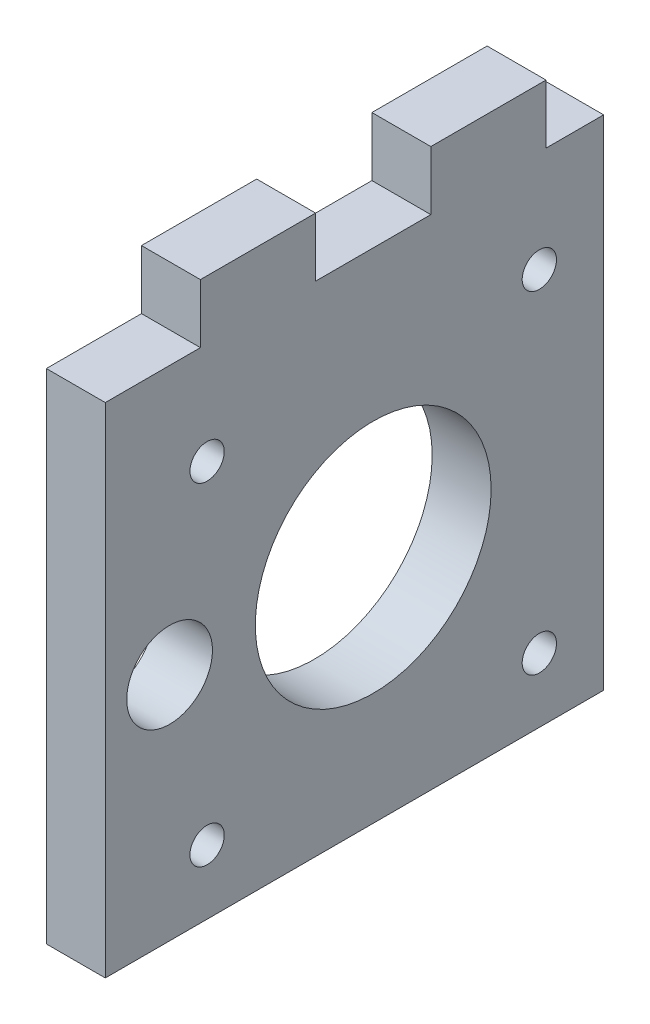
ISO-10303-21;
HEADER;
FILE_DESCRIPTION(('STEP AP214'),'2;1');
FILE_NAME('part.step','',(''),(''),'','','');
FILE_SCHEMA(('AUTOMOTIVE_DESIGN { 1 0 10303 214 1 1 1 1 }'));
ENDSEC;
DATA;
#1=APPLICATION_CONTEXT('core data for automotive mechanical design processes');
#2=APPLICATION_PROTOCOL_DEFINITION('international standard','automotive_design',2000,#1);
#3=PRODUCT_CONTEXT('',#1,'mechanical');
#4=PRODUCT('Part','Part','',(#3));
#5=PRODUCT_RELATED_PRODUCT_CATEGORY('part','',(#4));
#6=PRODUCT_DEFINITION_FORMATION('','',#4);
#7=PRODUCT_DEFINITION_CONTEXT('part definition',#1,'design');
#8=PRODUCT_DEFINITION('design','',#6,#7);
#9=PRODUCT_DEFINITION_SHAPE('','',#8);
#10=(LENGTH_UNIT() NAMED_UNIT(*) SI_UNIT(.MILLI.,.METRE.));
#11=(NAMED_UNIT(*) PLANE_ANGLE_UNIT() SI_UNIT($,.RADIAN.));
#12=(NAMED_UNIT(*) SI_UNIT($,.STERADIAN.) SOLID_ANGLE_UNIT());
#13=UNCERTAINTY_MEASURE_WITH_UNIT(LENGTH_MEASURE(1.E-05),#10,'distance_accuracy_value','');
#14=(GEOMETRIC_REPRESENTATION_CONTEXT(3) GLOBAL_UNCERTAINTY_ASSIGNED_CONTEXT((#13)) GLOBAL_UNIT_ASSIGNED_CONTEXT((#10,
#11,#12)) REPRESENTATION_CONTEXT('',''));
#15=CARTESIAN_POINT('',(0.,0.,0.));
#16=DIRECTION('',(0.,0.,1.));
#17=DIRECTION('',(1.,0.,0.));
#18=AXIS2_PLACEMENT_3D('',#15,#16,#17);
#19=CARTESIAN_POINT('',(5.5,0.,0.));
#20=DIRECTION('',(0.,0.,-1.));
#21=DIRECTION('',(-1.,0.,0.));
#22=AXIS2_PLACEMENT_3D('',#19,#20,#21);
#23=PLANE('',#22);
#24=DIRECTION('',(0.,-1.,0.));
#25=VECTOR('',#24,1.);
#26=CARTESIAN_POINT('',(0.,0.,0.));
#27=LINE('',#26,#25);
#28=CARTESIAN_POINT('',(0.,46.5,0.));
#29=VERTEX_POINT('',#28);
#30=CARTESIAN_POINT('',(0.,0.,0.));
#31=VERTEX_POINT('',#30);
#32=EDGE_CURVE('E189',#29,#31,#27,.T.);
#33=ORIENTED_EDGE('',*,*,#32,.F.);
#34=DIRECTION('',(-1.,0.,0.));
#35=VECTOR('',#34,1.);
#36=CARTESIAN_POINT('',(5.5,46.5,0.));
#37=LINE('',#36,#35);
#38=CARTESIAN_POINT('',(5.5,46.5,0.));
#39=VERTEX_POINT('',#38);
#40=EDGE_CURVE('E11',#39,#29,#37,.T.);
#41=ORIENTED_EDGE('',*,*,#40,.F.);
#42=DIRECTION('',(0.,-1.,0.));
#43=VECTOR('',#42,1.);
#44=CARTESIAN_POINT('',(5.5,0.,0.));
#45=LINE('',#44,#43);
#46=CARTESIAN_POINT('',(5.5,0.,0.));
#47=VERTEX_POINT('',#46);
#48=EDGE_CURVE('E469',#39,#47,#45,.T.);
#49=ORIENTED_EDGE('',*,*,#48,.T.);
#50=DIRECTION('',(-1.,0.,0.));
#51=VECTOR('',#50,1.);
#52=CARTESIAN_POINT('',(5.5,0.,0.));
#53=LINE('',#52,#51);
#54=EDGE_CURVE('E102',#47,#31,#53,.T.);
#55=ORIENTED_EDGE('',*,*,#54,.T.);
#56=EDGE_LOOP('',(#33,#41,#49,#55));
#57=FACE_BOUND('',#56,.T.);
#58=ADVANCED_FACE('F39',(#57),#23,.T.);
#59=CARTESIAN_POINT('',(5.5,46.5,0.));
#60=DIRECTION('',(0.,1.,0.));
#61=DIRECTION('',(0.,0.,1.));
#62=AXIS2_PLACEMENT_3D('',#59,#60,#61);
#63=PLANE('',#62);
#64=DIRECTION('',(0.,0.,-1.));
#65=VECTOR('',#64,1.);
#66=CARTESIAN_POINT('',(0.,46.5,0.));
#67=LINE('',#66,#65);
#68=CARTESIAN_POINT('',(0.,46.5,5.375));
#69=VERTEX_POINT('',#68);
#70=EDGE_CURVE('E187',#69,#29,#67,.T.);
#71=ORIENTED_EDGE('',*,*,#70,.F.);
#72=DIRECTION('',(-1.,0.,0.));
#73=VECTOR('',#72,1.);
#74=CARTESIAN_POINT('',(5.5,46.5,5.375));
#75=LINE('',#74,#73);
#76=CARTESIAN_POINT('',(5.5,46.5,5.375));
#77=VERTEX_POINT('',#76);
#78=EDGE_CURVE('E48',#77,#69,#75,.T.);
#79=ORIENTED_EDGE('',*,*,#78,.F.);
#80=DIRECTION('',(0.,0.,-1.));
#81=VECTOR('',#80,1.);
#82=CARTESIAN_POINT('',(5.5,46.5,0.));
#83=LINE('',#82,#81);
#84=EDGE_CURVE('E467',#77,#39,#83,.T.);
#85=ORIENTED_EDGE('',*,*,#84,.T.);
#86=ORIENTED_EDGE('',*,*,#40,.T.);
#87=EDGE_LOOP('',(#71,#79,#85,#86));
#88=FACE_BOUND('',#87,.T.);
#89=ADVANCED_FACE('F188',(#88),#63,.T.);
#90=CARTESIAN_POINT('',(5.5,0.,5.37500000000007));
#91=DIRECTION('',(0.,0.,-1.));
#92=DIRECTION('',(0.,1.,0.));
#93=AXIS2_PLACEMENT_3D('',#90,#91,#92);
#94=PLANE('',#93);
#95=DIRECTION('',(0.,-1.,0.));
#96=VECTOR('',#95,1.);
#97=CARTESIAN_POINT('',(0.,0.,5.37500000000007));
#98=LINE('',#97,#96);
#99=CARTESIAN_POINT('',(0.,52.,5.37499999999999));
#100=VERTEX_POINT('',#99);
#101=EDGE_CURVE('E179',#100,#69,#98,.T.);
#102=ORIENTED_EDGE('',*,*,#101,.F.);
#103=DIRECTION('',(-1.,0.,0.));
#104=VECTOR('',#103,1.);
#105=CARTESIAN_POINT('',(5.5,52.,5.37499999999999));
#106=LINE('',#105,#104);
#107=CARTESIAN_POINT('',(5.5,52.,5.37499999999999));
#108=VERTEX_POINT('',#107);
#109=EDGE_CURVE('E172',#108,#100,#106,.T.);
#110=ORIENTED_EDGE('',*,*,#109,.F.);
#111=DIRECTION('',(0.,-1.,0.));
#112=VECTOR('',#111,1.);
#113=CARTESIAN_POINT('',(5.5,0.,5.37500000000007));
#114=LINE('',#113,#112);
#115=EDGE_CURVE('E182',#108,#77,#114,.T.);
#116=ORIENTED_EDGE('',*,*,#115,.T.);
#117=ORIENTED_EDGE('',*,*,#78,.T.);
#118=EDGE_LOOP('',(#102,#110,#116,#117));
#119=FACE_BOUND('',#118,.T.);
#120=ADVANCED_FACE('F177',(#119),#94,.T.);
#121=CARTESIAN_POINT('',(5.5,52.,0.));
#122=DIRECTION('',(0.,1.,0.));
#123=DIRECTION('',(0.,0.,1.));
#124=AXIS2_PLACEMENT_3D('',#121,#122,#123);
#125=PLANE('',#124);
#126=DIRECTION('',(0.,0.,-1.));
#127=VECTOR('',#126,1.);
#128=CARTESIAN_POINT('',(0.,52.,0.));
#129=LINE('',#128,#127);
#130=CARTESIAN_POINT('',(0.,52.,16.125));
#131=VERTEX_POINT('',#130);
#132=EDGE_CURVE('E194',#131,#100,#129,.T.);
#133=ORIENTED_EDGE('',*,*,#132,.F.);
#134=DIRECTION('',(-1.,0.,0.));
#135=VECTOR('',#134,1.);
#136=CARTESIAN_POINT('',(5.5,52.,16.125));
#137=LINE('',#136,#135);
#138=CARTESIAN_POINT('',(5.5,52.,16.125));
#139=VERTEX_POINT('',#138);
#140=EDGE_CURVE('E170',#139,#131,#137,.T.);
#141=ORIENTED_EDGE('',*,*,#140,.F.);
#142=DIRECTION('',(0.,0.,-1.));
#143=VECTOR('',#142,1.);
#144=CARTESIAN_POINT('',(5.5,52.,0.));
#145=LINE('',#144,#143);
#146=EDGE_CURVE('E452',#139,#108,#145,.T.);
#147=ORIENTED_EDGE('',*,*,#146,.T.);
#148=ORIENTED_EDGE('',*,*,#109,.T.);
#149=EDGE_LOOP('',(#133,#141,#147,#148));
#150=FACE_BOUND('',#149,.T.);
#151=ADVANCED_FACE('F320',(#150),#125,.T.);
#152=CARTESIAN_POINT('',(5.5,0.,16.125));
#153=DIRECTION('',(0.,0.,1.));
#154=DIRECTION('',(1.,0.,0.));
#155=AXIS2_PLACEMENT_3D('',#152,#153,#154);
#156=PLANE('',#155);
#157=DIRECTION('',(0.,1.,0.));
#158=VECTOR('',#157,1.);
#159=CARTESIAN_POINT('',(0.,0.,16.125));
#160=LINE('',#159,#158);
#161=CARTESIAN_POINT('',(0.,46.5,16.125));
#162=VERTEX_POINT('',#161);
#163=EDGE_CURVE('E196',#162,#131,#160,.T.);
#164=ORIENTED_EDGE('',*,*,#163,.F.);
#165=DIRECTION('',(-1.,0.,0.));
#166=VECTOR('',#165,1.);
#167=CARTESIAN_POINT('',(5.5,46.5,16.125));
#168=LINE('',#167,#166);
#169=CARTESIAN_POINT('',(5.5,46.5,16.125));
#170=VERTEX_POINT('',#169);
#171=EDGE_CURVE('E168',#170,#162,#168,.T.);
#172=ORIENTED_EDGE('',*,*,#171,.F.);
#173=DIRECTION('',(0.,1.,0.));
#174=VECTOR('',#173,1.);
#175=CARTESIAN_POINT('',(5.5,0.,16.125));
#176=LINE('',#175,#174);
#177=EDGE_CURVE('E449',#170,#139,#176,.T.);
#178=ORIENTED_EDGE('',*,*,#177,.T.);
#179=ORIENTED_EDGE('',*,*,#140,.T.);
#180=EDGE_LOOP('',(#164,#172,#178,#179));
#181=FACE_BOUND('',#180,.T.);
#182=ADVANCED_FACE('F316',(#181),#156,.T.);
#183=CARTESIAN_POINT('',(5.5,46.5,0.));
#184=DIRECTION('',(0.,-1.,0.));
#185=DIRECTION('',(0.,0.,-1.));
#186=AXIS2_PLACEMENT_3D('',#183,#184,#185);
#187=PLANE('',#186);
#188=DIRECTION('',(0.,0.,1.));
#189=VECTOR('',#188,1.);
#190=CARTESIAN_POINT('',(0.,46.5,0.));
#191=LINE('',#190,#189);
#192=CARTESIAN_POINT('',(0.,46.5,26.875));
#193=VERTEX_POINT('',#192);
#194=EDGE_CURVE('E201',#162,#193,#191,.T.);
#195=ORIENTED_EDGE('',*,*,#194,.T.);
#196=DIRECTION('',(-1.,0.,0.));
#197=VECTOR('',#196,1.);
#198=CARTESIAN_POINT('',(5.5,46.5,26.875));
#199=LINE('',#198,#197);
#200=CARTESIAN_POINT('',(5.5,46.5,26.875));
#201=VERTEX_POINT('',#200);
#202=EDGE_CURVE('E165',#201,#193,#199,.T.);
#203=ORIENTED_EDGE('',*,*,#202,.F.);
#204=DIRECTION('',(0.,0.,1.));
#205=VECTOR('',#204,1.);
#206=CARTESIAN_POINT('',(5.5,46.5,0.));
#207=LINE('',#206,#205);
#208=EDGE_CURVE('E451',#170,#201,#207,.T.);
#209=ORIENTED_EDGE('',*,*,#208,.F.);
#210=ORIENTED_EDGE('',*,*,#171,.T.);
#211=EDGE_LOOP('',(#195,#203,#209,#210));
#212=FACE_BOUND('',#211,.T.);
#213=ADVANCED_FACE('F312',(#212),#187,.F.);
#214=CARTESIAN_POINT('',(5.5,0.,26.875));
#215=DIRECTION('',(0.,0.,1.));
#216=DIRECTION('',(1.,0.,0.));
#217=AXIS2_PLACEMENT_3D('',#214,#215,#216);
#218=PLANE('',#217);
#219=DIRECTION('',(0.,1.,0.));
#220=VECTOR('',#219,1.);
#221=CARTESIAN_POINT('',(0.,0.,26.875));
#222=LINE('',#221,#220);
#223=CARTESIAN_POINT('',(0.,52.,26.875));
#224=VERTEX_POINT('',#223);
#225=EDGE_CURVE('E204',#193,#224,#222,.T.);
#226=ORIENTED_EDGE('',*,*,#225,.T.);
#227=DIRECTION('',(-1.,0.,0.));
#228=VECTOR('',#227,1.);
#229=CARTESIAN_POINT('',(5.5,52.,26.875));
#230=LINE('',#229,#228);
#231=CARTESIAN_POINT('',(5.5,52.,26.875));
#232=VERTEX_POINT('',#231);
#233=EDGE_CURVE('E162',#232,#224,#230,.T.);
#234=ORIENTED_EDGE('',*,*,#233,.F.);
#235=DIRECTION('',(0.,1.,0.));
#236=VECTOR('',#235,1.);
#237=CARTESIAN_POINT('',(5.5,0.,26.875));
#238=LINE('',#237,#236);
#239=EDGE_CURVE('E454',#201,#232,#238,.T.);
#240=ORIENTED_EDGE('',*,*,#239,.F.);
#241=ORIENTED_EDGE('',*,*,#202,.T.);
#242=EDGE_LOOP('',(#226,#234,#240,#241));
#243=FACE_BOUND('',#242,.T.);
#244=ADVANCED_FACE('F308',(#243),#218,.F.);
#245=CARTESIAN_POINT('',(5.5,52.,0.));
#246=DIRECTION('',(0.,-1.,0.));
#247=DIRECTION('',(0.,0.,-1.));
#248=AXIS2_PLACEMENT_3D('',#245,#246,#247);
#249=PLANE('',#248);
#250=DIRECTION('',(0.,0.,1.));
#251=VECTOR('',#250,1.);
#252=CARTESIAN_POINT('',(0.,52.,0.));
#253=LINE('',#252,#251);
#254=CARTESIAN_POINT('',(0.,52.,37.625));
#255=VERTEX_POINT('',#254);
#256=EDGE_CURVE('E207',#224,#255,#253,.T.);
#257=ORIENTED_EDGE('',*,*,#256,.T.);
#258=DIRECTION('',(-1.,0.,0.));
#259=VECTOR('',#258,1.);
#260=CARTESIAN_POINT('',(5.5,52.,37.625));
#261=LINE('',#260,#259);
#262=CARTESIAN_POINT('',(5.5,52.,37.625));
#263=VERTEX_POINT('',#262);
#264=EDGE_CURVE('E155',#263,#255,#261,.T.);
#265=ORIENTED_EDGE('',*,*,#264,.F.);
#266=DIRECTION('',(0.,0.,1.));
#267=VECTOR('',#266,1.);
#268=CARTESIAN_POINT('',(5.5,52.,0.));
#269=LINE('',#268,#267);
#270=EDGE_CURVE('E461',#232,#263,#269,.T.);
#271=ORIENTED_EDGE('',*,*,#270,.F.);
#272=ORIENTED_EDGE('',*,*,#233,.T.);
#273=EDGE_LOOP('',(#257,#265,#271,#272));
#274=FACE_BOUND('',#273,.T.);
#275=ADVANCED_FACE('F304',(#274),#249,.F.);
#276=CARTESIAN_POINT('',(5.5,0.,37.625));
#277=DIRECTION('',(0.,0.,-1.));
#278=DIRECTION('',(-1.,0.,0.));
#279=AXIS2_PLACEMENT_3D('',#276,#277,#278);
#280=PLANE('',#279);
#281=DIRECTION('',(0.,-1.,0.));
#282=VECTOR('',#281,1.);
#283=CARTESIAN_POINT('',(0.,0.,37.625));
#284=LINE('',#283,#282);
#285=CARTESIAN_POINT('',(0.,46.5,37.625));
#286=VERTEX_POINT('',#285);
#287=EDGE_CURVE('E210',#255,#286,#284,.T.);
#288=ORIENTED_EDGE('',*,*,#287,.T.);
#289=DIRECTION('',(-1.,0.,0.));
#290=VECTOR('',#289,1.);
#291=CARTESIAN_POINT('',(5.5,46.5,37.625));
#292=LINE('',#291,#290);
#293=CARTESIAN_POINT('',(5.5,46.5,37.625));
#294=VERTEX_POINT('',#293);
#295=EDGE_CURVE('E153',#294,#286,#292,.T.);
#296=ORIENTED_EDGE('',*,*,#295,.F.);
#297=DIRECTION('',(0.,-1.,0.));
#298=VECTOR('',#297,1.);
#299=CARTESIAN_POINT('',(5.5,0.,37.625));
#300=LINE('',#299,#298);
#301=EDGE_CURVE('E146',#263,#294,#300,.T.);
#302=ORIENTED_EDGE('',*,*,#301,.F.);
#303=ORIENTED_EDGE('',*,*,#264,.T.);
#304=EDGE_LOOP('',(#288,#296,#302,#303));
#305=FACE_BOUND('',#304,.T.);
#306=ADVANCED_FACE('F301',(#305),#280,.F.);
#307=CARTESIAN_POINT('',(5.5,46.5,0.));
#308=DIRECTION('',(0.,-1.,0.));
#309=DIRECTION('',(0.,0.,-1.));
#310=AXIS2_PLACEMENT_3D('',#307,#308,#309);
#311=PLANE('',#310);
#312=DIRECTION('',(0.,0.,1.));
#313=VECTOR('',#312,1.);
#314=CARTESIAN_POINT('',(0.,46.5,0.));
#315=LINE('',#314,#313);
#316=CARTESIAN_POINT('',(0.,46.5,46.5));
#317=VERTEX_POINT('',#316);
#318=EDGE_CURVE('E152',#286,#317,#315,.T.);
#319=ORIENTED_EDGE('',*,*,#318,.T.);
#320=DIRECTION('',(-1.,0.,0.));
#321=VECTOR('',#320,1.);
#322=CARTESIAN_POINT('',(5.5,46.5,46.5));
#323=LINE('',#322,#321);
#324=CARTESIAN_POINT('',(5.5,46.5,46.5));
#325=VERTEX_POINT('',#324);
#326=EDGE_CURVE('E138',#325,#317,#323,.T.);
#327=ORIENTED_EDGE('',*,*,#326,.F.);
#328=DIRECTION('',(0.,0.,1.));
#329=VECTOR('',#328,1.);
#330=CARTESIAN_POINT('',(5.5,46.5,0.));
#331=LINE('',#330,#329);
#332=EDGE_CURVE('E141',#294,#325,#331,.T.);
#333=ORIENTED_EDGE('',*,*,#332,.F.);
#334=ORIENTED_EDGE('',*,*,#295,.T.);
#335=EDGE_LOOP('',(#319,#327,#333,#334));
#336=FACE_BOUND('',#335,.T.);
#337=ADVANCED_FACE('F151',(#336),#311,.F.);
#338=CARTESIAN_POINT('',(5.5,0.,46.5));
#339=DIRECTION('',(0.,0.,-1.));
#340=DIRECTION('',(0.,1.,0.));
#341=AXIS2_PLACEMENT_3D('',#338,#339,#340);
#342=PLANE('',#341);
#343=DIRECTION('',(0.,-1.,0.));
#344=VECTOR('',#343,1.);
#345=CARTESIAN_POINT('',(0.,0.,46.5));
#346=LINE('',#345,#344);
#347=CARTESIAN_POINT('',(0.,0.,46.5));
#348=VERTEX_POINT('',#347);
#349=EDGE_CURVE('E214',#317,#348,#346,.T.);
#350=ORIENTED_EDGE('',*,*,#349,.T.);
#351=DIRECTION('',(-1.,0.,0.));
#352=VECTOR('',#351,1.);
#353=CARTESIAN_POINT('',(5.5,0.,46.5));
#354=LINE('',#353,#352);
#355=CARTESIAN_POINT('',(5.5,0.,46.5));
#356=VERTEX_POINT('',#355);
#357=EDGE_CURVE('E140',#356,#348,#354,.T.);
#358=ORIENTED_EDGE('',*,*,#357,.F.);
#359=DIRECTION('',(0.,-1.,0.));
#360=VECTOR('',#359,1.);
#361=CARTESIAN_POINT('',(5.5,0.,46.5));
#362=LINE('',#361,#360);
#363=EDGE_CURVE('E133',#325,#356,#362,.T.);
#364=ORIENTED_EDGE('',*,*,#363,.F.);
#365=ORIENTED_EDGE('',*,*,#326,.T.);
#366=EDGE_LOOP('',(#350,#358,#364,#365));
#367=FACE_BOUND('',#366,.T.);
#368=ADVANCED_FACE('F136',(#367),#342,.F.);
#369=CARTESIAN_POINT('',(5.5,21.5,21.5));
#370=DIRECTION('',(-1.,0.,0.));
#371=DIRECTION('',(0.,0.,1.));
#372=AXIS2_PLACEMENT_3D('',#369,#370,#371);
#373=CYLINDRICAL_SURFACE('',#372,11.);
#374=CARTESIAN_POINT('',(5.5,21.5,21.5));
#375=DIRECTION('',(1.,0.,0.));
#376=DIRECTION('',(0.,0.,-1.));
#377=AXIS2_PLACEMENT_3D('',#374,#375,#376);
#378=CIRCLE('',#377,11.);
#379=CARTESIAN_POINT('',(5.5,21.5,10.5));
#380=VERTEX_POINT('',#379);
#381=EDGE_CURVE('E471',#380,#380,#378,.T.);
#382=ORIENTED_EDGE('',*,*,#381,.T.);
#383=EDGE_LOOP('',(#382));
#384=FACE_BOUND('',#383,.T.);
#385=CARTESIAN_POINT('',(0.,21.5,21.5));
#386=DIRECTION('',(1.,0.,0.));
#387=DIRECTION('',(0.,0.,-1.));
#388=AXIS2_PLACEMENT_3D('',#385,#386,#387);
#389=CIRCLE('',#388,11.);
#390=CARTESIAN_POINT('',(0.,21.5,10.5));
#391=VERTEX_POINT('',#390);
#392=EDGE_CURVE('E234',#391,#391,#389,.T.);
#393=ORIENTED_EDGE('',*,*,#392,.F.);
#394=EDGE_LOOP('',(#393));
#395=FACE_BOUND('',#394,.T.);
#396=ADVANCED_FACE('F244',(#384,#395),#373,.F.);
#397=CARTESIAN_POINT('',(5.5,37.,6.));
#398=DIRECTION('',(-1.,0.,0.));
#399=DIRECTION('',(0.,0.,1.));
#400=AXIS2_PLACEMENT_3D('',#397,#398,#399);
#401=CYLINDRICAL_SURFACE('',#400,1.6);
#402=CARTESIAN_POINT('',(5.5,37.,6.));
#403=DIRECTION('',(1.,0.,0.));
#404=DIRECTION('',(0.,0.,-1.));
#405=AXIS2_PLACEMENT_3D('',#402,#403,#404);
#406=CIRCLE('',#405,1.6);
#407=CARTESIAN_POINT('',(5.5,37.,4.4));
#408=VERTEX_POINT('',#407);
#409=EDGE_CURVE('E474',#408,#408,#406,.T.);
#410=ORIENTED_EDGE('',*,*,#409,.T.);
#411=EDGE_LOOP('',(#410));
#412=FACE_BOUND('',#411,.T.);
#413=CARTESIAN_POINT('',(0.,37.,6.));
#414=DIRECTION('',(1.,0.,0.));
#415=DIRECTION('',(0.,0.,-1.));
#416=AXIS2_PLACEMENT_3D('',#413,#414,#415);
#417=CIRCLE('',#416,1.6);
#418=CARTESIAN_POINT('',(0.,37.,4.4));
#419=VERTEX_POINT('',#418);
#420=EDGE_CURVE('E231',#419,#419,#417,.T.);
#421=ORIENTED_EDGE('',*,*,#420,.F.);
#422=EDGE_LOOP('',(#421));
#423=FACE_BOUND('',#422,.T.);
#424=ADVANCED_FACE('F247',(#412,#423),#401,.F.);
#425=CARTESIAN_POINT('',(5.5,5.99999999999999,5.99999999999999));
#426=DIRECTION('',(-1.,0.,0.));
#427=DIRECTION('',(0.,0.,1.));
#428=AXIS2_PLACEMENT_3D('',#425,#426,#427);
#429=CYLINDRICAL_SURFACE('',#428,1.6);
#430=CARTESIAN_POINT('',(5.5,5.99999999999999,5.99999999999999));
#431=DIRECTION('',(1.,0.,0.));
#432=DIRECTION('',(0.,0.,-1.));
#433=AXIS2_PLACEMENT_3D('',#430,#431,#432);
#434=CIRCLE('',#433,1.6);
#435=CARTESIAN_POINT('',(5.5,5.99999999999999,4.39999999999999));
#436=VERTEX_POINT('',#435);
#437=EDGE_CURVE('E477',#436,#436,#434,.T.);
#438=ORIENTED_EDGE('',*,*,#437,.T.);
#439=EDGE_LOOP('',(#438));
#440=FACE_BOUND('',#439,.T.);
#441=CARTESIAN_POINT('',(0.,5.99999999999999,5.99999999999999));
#442=DIRECTION('',(1.,0.,0.));
#443=DIRECTION('',(0.,0.,-1.));
#444=AXIS2_PLACEMENT_3D('',#441,#442,#443);
#445=CIRCLE('',#444,1.6);
#446=CARTESIAN_POINT('',(0.,5.99999999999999,4.39999999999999));
#447=VERTEX_POINT('',#446);
#448=EDGE_CURVE('E228',#447,#447,#445,.T.);
#449=ORIENTED_EDGE('',*,*,#448,.F.);
#450=EDGE_LOOP('',(#449));
#451=FACE_BOUND('',#450,.T.);
#452=ADVANCED_FACE('F251',(#440,#451),#429,.F.);
#453=CARTESIAN_POINT('',(5.5,6.00000000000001,37.));
#454=DIRECTION('',(-1.,0.,0.));
#455=DIRECTION('',(0.,0.,1.));
#456=AXIS2_PLACEMENT_3D('',#453,#454,#455);
#457=CYLINDRICAL_SURFACE('',#456,1.6);
#458=CARTESIAN_POINT('',(5.5,6.00000000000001,37.));
#459=DIRECTION('',(1.,0.,0.));
#460=DIRECTION('',(0.,0.,-1.));
#461=AXIS2_PLACEMENT_3D('',#458,#459,#460);
#462=CIRCLE('',#461,1.6);
#463=CARTESIAN_POINT('',(5.5,6.00000000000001,35.4));
#464=VERTEX_POINT('',#463);
#465=EDGE_CURVE('E480',#464,#464,#462,.T.);
#466=ORIENTED_EDGE('',*,*,#465,.T.);
#467=EDGE_LOOP('',(#466));
#468=FACE_BOUND('',#467,.T.);
#469=CARTESIAN_POINT('',(0.,6.00000000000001,37.));
#470=DIRECTION('',(1.,0.,0.));
#471=DIRECTION('',(0.,0.,-1.));
#472=AXIS2_PLACEMENT_3D('',#469,#470,#471);
#473=CIRCLE('',#472,1.6);
#474=CARTESIAN_POINT('',(0.,6.00000000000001,35.4));
#475=VERTEX_POINT('',#474);
#476=EDGE_CURVE('E225',#475,#475,#473,.T.);
#477=ORIENTED_EDGE('',*,*,#476,.F.);
#478=EDGE_LOOP('',(#477));
#479=FACE_BOUND('',#478,.T.);
#480=ADVANCED_FACE('F255',(#468,#479),#457,.F.);
#481=CARTESIAN_POINT('',(5.5,37.,37.));
#482=DIRECTION('',(-1.,0.,0.));
#483=DIRECTION('',(0.,0.,1.));
#484=AXIS2_PLACEMENT_3D('',#481,#482,#483);
#485=CYLINDRICAL_SURFACE('',#484,1.6);
#486=CARTESIAN_POINT('',(5.5,37.,37.));
#487=DIRECTION('',(1.,0.,0.));
#488=DIRECTION('',(0.,0.,-1.));
#489=AXIS2_PLACEMENT_3D('',#486,#487,#488);
#490=CIRCLE('',#489,1.6);
#491=CARTESIAN_POINT('',(5.5,37.,35.4));
#492=VERTEX_POINT('',#491);
#493=EDGE_CURVE('E270',#492,#492,#490,.T.);
#494=ORIENTED_EDGE('',*,*,#493,.T.);
#495=EDGE_LOOP('',(#494));
#496=FACE_BOUND('',#495,.T.);
#497=CARTESIAN_POINT('',(0.,37.,37.));
#498=DIRECTION('',(1.,0.,0.));
#499=DIRECTION('',(0.,0.,-1.));
#500=AXIS2_PLACEMENT_3D('',#497,#498,#499);
#501=CIRCLE('',#500,1.6);
#502=CARTESIAN_POINT('',(0.,37.,35.4));
#503=VERTEX_POINT('',#502);
#504=EDGE_CURVE('E222',#503,#503,#501,.T.);
#505=ORIENTED_EDGE('',*,*,#504,.F.);
#506=EDGE_LOOP('',(#505));
#507=FACE_BOUND('',#506,.T.);
#508=ADVANCED_FACE('F258',(#496,#507),#485,.F.);
#509=CARTESIAN_POINT('',(5.5,21.5,40.5));
#510=DIRECTION('',(-1.,0.,0.));
#511=DIRECTION('',(0.,0.,1.));
#512=AXIS2_PLACEMENT_3D('',#509,#510,#511);
#513=CYLINDRICAL_SURFACE('',#512,4.);
#514=CARTESIAN_POINT('',(5.5,21.5,40.5));
#515=DIRECTION('',(1.,0.,0.));
#516=DIRECTION('',(0.,0.,-1.));
#517=AXIS2_PLACEMENT_3D('',#514,#515,#516);
#518=CIRCLE('',#517,4.);
#519=CARTESIAN_POINT('',(5.5,21.5,36.5));
#520=VERTEX_POINT('',#519);
#521=EDGE_CURVE('E216',#520,#520,#518,.T.);
#522=ORIENTED_EDGE('',*,*,#521,.T.);
#523=EDGE_LOOP('',(#522));
#524=FACE_BOUND('',#523,.T.);
#525=CARTESIAN_POINT('',(0.,21.5,40.5));
#526=DIRECTION('',(1.,0.,0.));
#527=DIRECTION('',(0.,0.,-1.));
#528=AXIS2_PLACEMENT_3D('',#525,#526,#527);
#529=CIRCLE('',#528,4.);
#530=CARTESIAN_POINT('',(0.,21.5,36.5));
#531=VERTEX_POINT('',#530);
#532=EDGE_CURVE('E219',#531,#531,#529,.T.);
#533=ORIENTED_EDGE('',*,*,#532,.F.);
#534=EDGE_LOOP('',(#533));
#535=FACE_BOUND('',#534,.T.);
#536=ADVANCED_FACE('F41',(#524,#535),#513,.F.);
#537=CARTESIAN_POINT('',(5.5,0.,0.));
#538=DIRECTION('',(0.,1.,0.));
#539=DIRECTION('',(0.,0.,1.));
#540=AXIS2_PLACEMENT_3D('',#537,#538,#539);
#541=PLANE('',#540);
#542=DIRECTION('',(0.,0.,-1.));
#543=VECTOR('',#542,1.);
#544=CARTESIAN_POINT('',(0.,0.,0.));
#545=LINE('',#544,#543);
#546=EDGE_CURVE('E95',#348,#31,#545,.T.);
#547=ORIENTED_EDGE('',*,*,#546,.T.);
#548=ORIENTED_EDGE('',*,*,#54,.F.);
#549=DIRECTION('',(0.,0.,-1.));
#550=VECTOR('',#549,1.);
#551=CARTESIAN_POINT('',(5.5,0.,0.));
#552=LINE('',#551,#550);
#553=EDGE_CURVE('E56',#356,#47,#552,.T.);
#554=ORIENTED_EDGE('',*,*,#553,.F.);
#555=ORIENTED_EDGE('',*,*,#357,.T.);
#556=EDGE_LOOP('',(#547,#548,#554,#555));
#557=FACE_BOUND('',#556,.T.);
#558=ADVANCED_FACE('F265',(#557),#541,.F.);
#559=CARTESIAN_POINT('',(5.5,0.,0.));
#560=DIRECTION('',(1.,0.,0.));
#561=DIRECTION('',(0.,0.,-1.));
#562=AXIS2_PLACEMENT_3D('',#559,#560,#561);
#563=PLANE('',#562);
#564=ORIENTED_EDGE('',*,*,#521,.F.);
#565=EDGE_LOOP('',(#564));
#566=FACE_BOUND('',#565,.T.);
#567=ORIENTED_EDGE('',*,*,#493,.F.);
#568=EDGE_LOOP('',(#567));
#569=FACE_BOUND('',#568,.T.);
#570=ORIENTED_EDGE('',*,*,#465,.F.);
#571=EDGE_LOOP('',(#570));
#572=FACE_BOUND('',#571,.T.);
#573=ORIENTED_EDGE('',*,*,#437,.F.);
#574=EDGE_LOOP('',(#573));
#575=FACE_BOUND('',#574,.T.);
#576=ORIENTED_EDGE('',*,*,#409,.F.);
#577=EDGE_LOOP('',(#576));
#578=FACE_BOUND('',#577,.T.);
#579=ORIENTED_EDGE('',*,*,#381,.F.);
#580=EDGE_LOOP('',(#579));
#581=FACE_BOUND('',#580,.T.);
#582=ORIENTED_EDGE('',*,*,#48,.F.);
#583=ORIENTED_EDGE('',*,*,#84,.F.);
#584=ORIENTED_EDGE('',*,*,#115,.F.);
#585=ORIENTED_EDGE('',*,*,#146,.F.);
#586=ORIENTED_EDGE('',*,*,#177,.F.);
#587=ORIENTED_EDGE('',*,*,#208,.T.);
#588=ORIENTED_EDGE('',*,*,#239,.T.);
#589=ORIENTED_EDGE('',*,*,#270,.T.);
#590=ORIENTED_EDGE('',*,*,#301,.T.);
#591=ORIENTED_EDGE('',*,*,#332,.T.);
#592=ORIENTED_EDGE('',*,*,#363,.T.);
#593=ORIENTED_EDGE('',*,*,#553,.T.);
#594=EDGE_LOOP('',(#582,#583,#584,#585,#586,#587,#588,#589,#590,#591,#592,#593));
#595=FACE_BOUND('',#594,.T.);
#596=ADVANCED_FACE('F144',(#566,#569,#572,#575,#578,#581,#595),#563,.T.);
#597=CARTESIAN_POINT('',(0.,0.,0.));
#598=DIRECTION('',(1.,0.,0.));
#599=DIRECTION('',(0.,0.,-1.));
#600=AXIS2_PLACEMENT_3D('',#597,#598,#599);
#601=PLANE('',#600);
#602=ORIENTED_EDGE('',*,*,#532,.T.);
#603=EDGE_LOOP('',(#602));
#604=FACE_BOUND('',#603,.T.);
#605=ORIENTED_EDGE('',*,*,#504,.T.);
#606=EDGE_LOOP('',(#605));
#607=FACE_BOUND('',#606,.T.);
#608=ORIENTED_EDGE('',*,*,#476,.T.);
#609=EDGE_LOOP('',(#608));
#610=FACE_BOUND('',#609,.T.);
#611=ORIENTED_EDGE('',*,*,#448,.T.);
#612=EDGE_LOOP('',(#611));
#613=FACE_BOUND('',#612,.T.);
#614=ORIENTED_EDGE('',*,*,#420,.T.);
#615=EDGE_LOOP('',(#614));
#616=FACE_BOUND('',#615,.T.);
#617=ORIENTED_EDGE('',*,*,#392,.T.);
#618=EDGE_LOOP('',(#617));
#619=FACE_BOUND('',#618,.T.);
#620=ORIENTED_EDGE('',*,*,#32,.T.);
#621=ORIENTED_EDGE('',*,*,#546,.F.);
#622=ORIENTED_EDGE('',*,*,#349,.F.);
#623=ORIENTED_EDGE('',*,*,#318,.F.);
#624=ORIENTED_EDGE('',*,*,#287,.F.);
#625=ORIENTED_EDGE('',*,*,#256,.F.);
#626=ORIENTED_EDGE('',*,*,#225,.F.);
#627=ORIENTED_EDGE('',*,*,#194,.F.);
#628=ORIENTED_EDGE('',*,*,#163,.T.);
#629=ORIENTED_EDGE('',*,*,#132,.T.);
#630=ORIENTED_EDGE('',*,*,#101,.T.);
#631=ORIENTED_EDGE('',*,*,#70,.T.);
#632=EDGE_LOOP('',(#620,#621,#622,#623,#624,#625,#626,#627,#628,#629,#630,#631));
#633=FACE_BOUND('',#632,.T.);
#634=ADVANCED_FACE('F191',(#604,#607,#610,#613,#616,#619,#633),#601,.F.);
#635=CLOSED_SHELL('',(#58,#89,#120,#151,#182,#213,#244,#275,#306,#337,#368,#396,#424,#452,#480,
#508,#536,#558,#596,#634));
#636=MANIFOLD_SOLID_BREP('B2',#635);
#637=ADVANCED_BREP_SHAPE_REPRESENTATION('',(#18,#636),#14);
#638=SHAPE_DEFINITION_REPRESENTATION(#9,#637);
ENDSEC;
END-ISO-10303-21;
